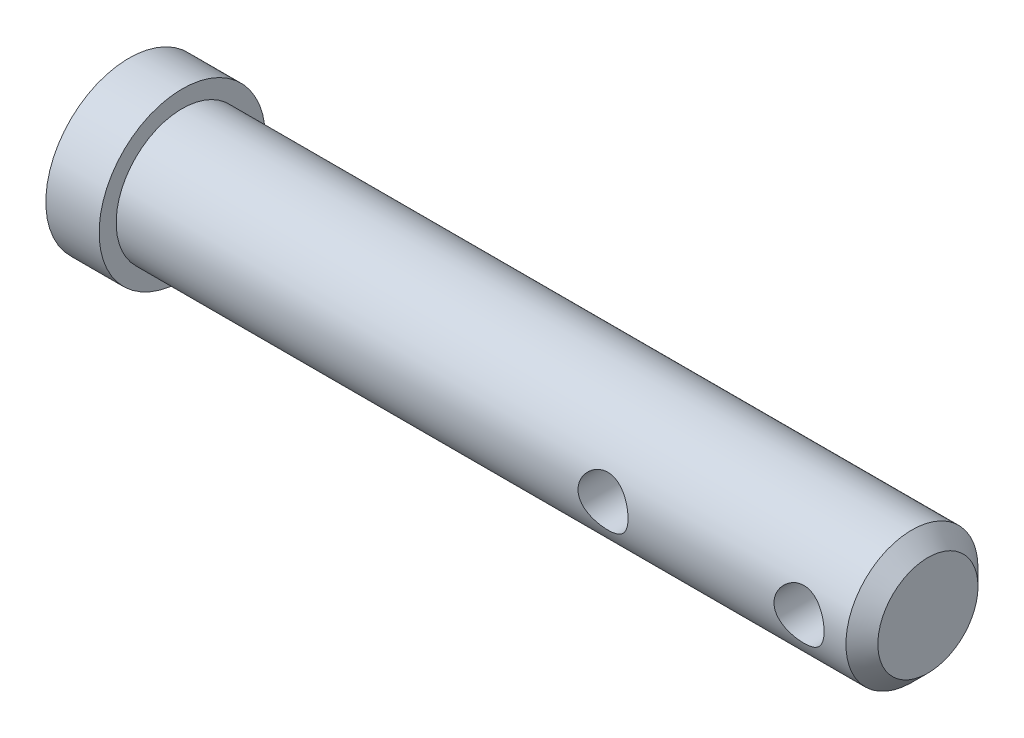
from build123d import *

# Parameters (mm, degrees)
CUT_EXTRUDE1_DEPTH      = 20.857082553
CUT_EXTRUDE1_DEPTH_BACK = 20.857082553
SKETCH2_R               = 1.1938
CHAMFER1_SIZE           = 0.762


with BuildPart() as part:
    # Sketch1 → Base-Revolve (revolve)
    with BuildSketch(Plane.XY, mode=Mode.PRIVATE) as base_revolve_sk:
        Polygon((-19.05, 0), (-19.05, 3.9624), (-16.51, 3.9624), (-16.51, 3.1496), (19.05, 3.1496), (19.05, 0), align=None)
    revolve(base_revolve_sk.sketch.rotate(Axis((-19.05, 0, 0), (-1, 0, 0)), 90), axis=Axis((-19.05, 0, 0), (-1, 0, 0)))

    # Sketch2 → Cut-Extrude1 (cut, two sides: drawn at the far end of the back side and taken through both)
    with BuildSketch(Plane.XY.offset(-CUT_EXTRUDE1_DEPTH_BACK)):
        with Locations((16.0528, 0)):
            Circle(SKETCH2_R)
        with Locations((6.7056, 0)):
            Circle(SKETCH2_R)
    extrude(amount=CUT_EXTRUDE1_DEPTH + CUT_EXTRUDE1_DEPTH_BACK, mode=Mode.SUBTRACT)

    # Chamfer1
    chamfer1_edges = [part.edges().sort_by_distance(p)[0] for p in [
        (19.05, 0, 3.1496),
    ]]
    chamfer(chamfer1_edges, length=CHAMFER1_SIZE)


solid = part.part
